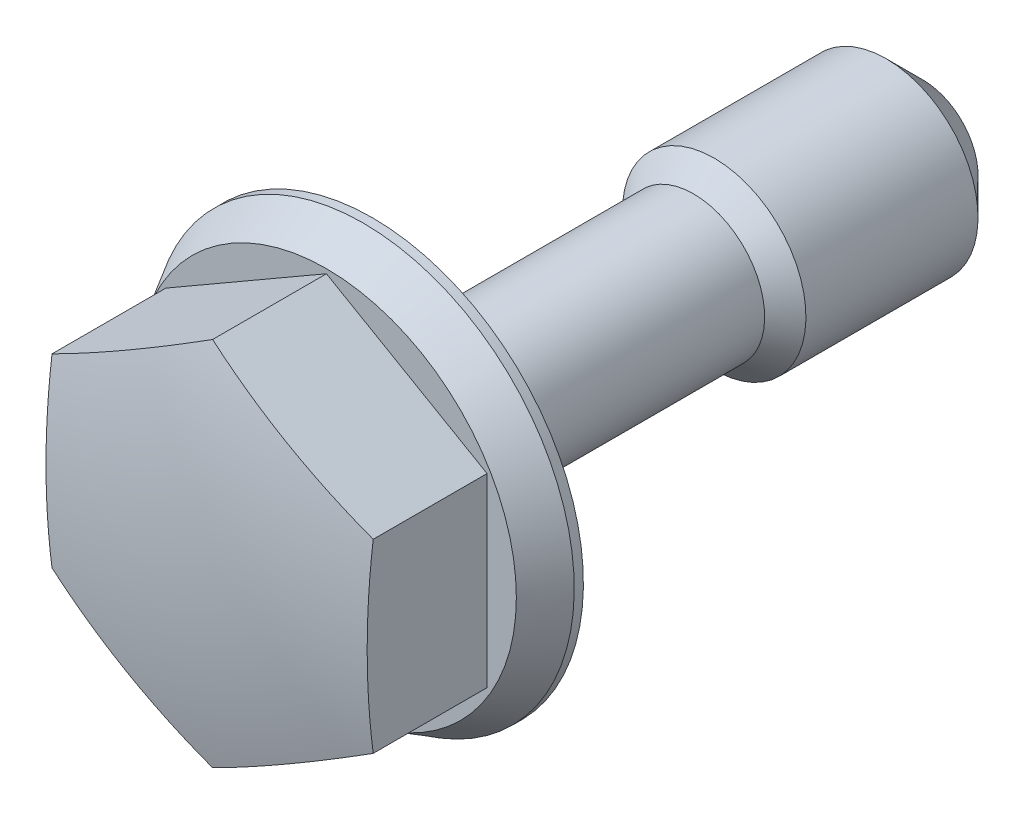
ISO-10303-21;
HEADER;
FILE_DESCRIPTION(('STEP AP214'),'2;1');
FILE_NAME('part.step','',(''),(''),'','','');
FILE_SCHEMA(('AUTOMOTIVE_DESIGN { 1 0 10303 214 1 1 1 1 }'));
ENDSEC;
DATA;
#1=APPLICATION_CONTEXT('core data for automotive mechanical design processes');
#2=APPLICATION_PROTOCOL_DEFINITION('international standard','automotive_design',2000,#1);
#3=PRODUCT_CONTEXT('',#1,'mechanical');
#4=PRODUCT('Part','Part','',(#3));
#5=PRODUCT_RELATED_PRODUCT_CATEGORY('part','',(#4));
#6=PRODUCT_DEFINITION_FORMATION('','',#4);
#7=PRODUCT_DEFINITION_CONTEXT('part definition',#1,'design');
#8=PRODUCT_DEFINITION('design','',#6,#7);
#9=PRODUCT_DEFINITION_SHAPE('','',#8);
#10=(LENGTH_UNIT() NAMED_UNIT(*) SI_UNIT(.MILLI.,.METRE.));
#11=(NAMED_UNIT(*) PLANE_ANGLE_UNIT() SI_UNIT($,.RADIAN.));
#12=(NAMED_UNIT(*) SI_UNIT($,.STERADIAN.) SOLID_ANGLE_UNIT());
#13=UNCERTAINTY_MEASURE_WITH_UNIT(LENGTH_MEASURE(1.E-05),#10,'distance_accuracy_value','');
#14=(GEOMETRIC_REPRESENTATION_CONTEXT(3) GLOBAL_UNCERTAINTY_ASSIGNED_CONTEXT((#13)) GLOBAL_UNIT_ASSIGNED_CONTEXT((#10,
#11,#12)) REPRESENTATION_CONTEXT('',''));
#15=CARTESIAN_POINT('',(0.,0.,0.));
#16=DIRECTION('',(0.,0.,1.));
#17=DIRECTION('',(1.,0.,0.));
#18=AXIS2_PLACEMENT_3D('',#15,#16,#17);
#19=CARTESIAN_POINT('',(0.,0.,1.));
#20=DIRECTION('',(0.,0.,-1.));
#21=DIRECTION('',(0.,1.,0.));
#22=AXIS2_PLACEMENT_3D('',#19,#20,#21);
#23=CONICAL_SURFACE('',#22,4.1381197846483,0.523598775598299);
#24=CARTESIAN_POINT('',(0.,0.,0.2));
#25=DIRECTION('',(0.,0.,-1.));
#26=DIRECTION('',(0.,1.,0.));
#27=AXIS2_PLACEMENT_3D('',#24,#25,#26);
#28=CIRCLE('',#27,4.6);
#29=CARTESIAN_POINT('',(0.,4.6,0.2));
#30=VERTEX_POINT('',#29);
#31=EDGE_CURVE('E117',#30,#30,#28,.T.);
#32=ORIENTED_EDGE('',*,*,#31,.F.);
#33=EDGE_LOOP('',(#32));
#34=FACE_BOUND('',#33,.T.);
#35=CARTESIAN_POINT('',(0.,0.,1.));
#36=DIRECTION('',(0.,0.,1.));
#37=DIRECTION('',(0.,-1.,0.));
#38=AXIS2_PLACEMENT_3D('',#35,#36,#37);
#39=CIRCLE('',#38,4.1381197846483);
#40=CARTESIAN_POINT('',(0.,-4.1381197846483,1.));
#41=VERTEX_POINT('',#40);
#42=EDGE_CURVE('E95',#41,#41,#39,.T.);
#43=ORIENTED_EDGE('',*,*,#42,.F.);
#44=EDGE_LOOP('',(#43));
#45=FACE_BOUND('',#44,.T.);
#46=ADVANCED_FACE('F14',(#34,#45),#23,.T.);
#47=CARTESIAN_POINT('',(0.,0.,-8.));
#48=DIRECTION('',(0.,0.,-1.));
#49=DIRECTION('',(0.,1.,0.));
#50=AXIS2_PLACEMENT_3D('',#47,#48,#49);
#51=CYLINDRICAL_SURFACE('',#50,4.6);
#52=CARTESIAN_POINT('',(0.,0.,0.));
#53=DIRECTION('',(0.,0.,-1.));
#54=DIRECTION('',(0.,1.,0.));
#55=AXIS2_PLACEMENT_3D('',#52,#53,#54);
#56=CIRCLE('',#55,4.6);
#57=CARTESIAN_POINT('',(0.,4.6,0.));
#58=VERTEX_POINT('',#57);
#59=EDGE_CURVE('E114',#58,#58,#56,.T.);
#60=ORIENTED_EDGE('',*,*,#59,.F.);
#61=EDGE_LOOP('',(#60));
#62=FACE_BOUND('',#61,.T.);
#63=ORIENTED_EDGE('',*,*,#31,.T.);
#64=EDGE_LOOP('',(#63));
#65=FACE_BOUND('',#64,.T.);
#66=ADVANCED_FACE('F156',(#62,#65),#51,.T.);
#67=CARTESIAN_POINT('',(4.6,0.,0.));
#68=DIRECTION('',(0.,0.,1.));
#69=DIRECTION('',(0.,-1.,0.));
#70=AXIS2_PLACEMENT_3D('',#67,#68,#69);
#71=PLANE('',#70);
#72=CARTESIAN_POINT('',(0.,0.,0.));
#73=DIRECTION('',(0.,0.,-1.));
#74=DIRECTION('',(0.,1.,0.));
#75=AXIS2_PLACEMENT_3D('',#72,#73,#74);
#76=CIRCLE('',#75,2.15);
#77=CARTESIAN_POINT('',(0.,2.15,0.));
#78=VERTEX_POINT('',#77);
#79=EDGE_CURVE('E111',#78,#78,#76,.T.);
#80=ORIENTED_EDGE('',*,*,#79,.F.);
#81=EDGE_LOOP('',(#80));
#82=FACE_BOUND('',#81,.T.);
#83=ORIENTED_EDGE('',*,*,#59,.T.);
#84=EDGE_LOOP('',(#83));
#85=FACE_BOUND('',#84,.T.);
#86=ADVANCED_FACE('F162',(#82,#85),#71,.F.);
#87=CARTESIAN_POINT('',(0.,0.,-0.6));
#88=DIRECTION('',(0.,0.,-1.));
#89=DIRECTION('',(0.,1.,0.));
#90=AXIS2_PLACEMENT_3D('',#87,#88,#89);
#91=TOROIDAL_SURFACE('',#90,2.15,0.6);
#92=CARTESIAN_POINT('',(0.,0.,-0.6));
#93=DIRECTION('',(0.,0.,-1.));
#94=DIRECTION('',(0.,1.,0.));
#95=AXIS2_PLACEMENT_3D('',#92,#93,#94);
#96=CIRCLE('',#95,1.55);
#97=CARTESIAN_POINT('',(0.,1.55,-0.6));
#98=VERTEX_POINT('',#97);
#99=EDGE_CURVE('E108',#98,#98,#96,.T.);
#100=ORIENTED_EDGE('',*,*,#99,.F.);
#101=EDGE_LOOP('',(#100));
#102=FACE_BOUND('',#101,.T.);
#103=ORIENTED_EDGE('',*,*,#79,.T.);
#104=EDGE_LOOP('',(#103));
#105=FACE_BOUND('',#104,.T.);
#106=ADVANCED_FACE('F195',(#102,#105),#91,.F.);
#107=CARTESIAN_POINT('',(0.,0.,-8.));
#108=DIRECTION('',(0.,0.,-1.));
#109=DIRECTION('',(0.,1.,0.));
#110=AXIS2_PLACEMENT_3D('',#107,#108,#109);
#111=CYLINDRICAL_SURFACE('',#110,1.55);
#112=ORIENTED_EDGE('',*,*,#99,.T.);
#113=EDGE_LOOP('',(#112));
#114=FACE_BOUND('',#113,.T.);
#115=CARTESIAN_POINT('',(0.,0.,-7.));
#116=DIRECTION('',(0.,0.,-1.));
#117=DIRECTION('',(0.,1.,0.));
#118=AXIS2_PLACEMENT_3D('',#115,#116,#117);
#119=CIRCLE('',#118,1.55);
#120=CARTESIAN_POINT('',(0.,1.55,-7.));
#121=VERTEX_POINT('',#120);
#122=EDGE_CURVE('E83',#121,#121,#119,.T.);
#123=ORIENTED_EDGE('',*,*,#122,.F.);
#124=EDGE_LOOP('',(#123));
#125=FACE_BOUND('',#124,.T.);
#126=ADVANCED_FACE('F193',(#114,#125),#111,.T.);
#127=CARTESIAN_POINT('',(0.,0.,1.));
#128=DIRECTION('',(0.,0.,1.));
#129=DIRECTION('',(0.,-1.,0.));
#130=AXIS2_PLACEMENT_3D('',#127,#128,#129);
#131=PLANE('',#130);
#132=DIRECTION('',(0.,-1.,0.));
#133=VECTOR('',#132,1.);
#134=CARTESIAN_POINT('',(-3.5,2.02072594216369,1.));
#135=LINE('',#134,#133);
#136=CARTESIAN_POINT('',(-3.5,2.02072594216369,1.));
#137=VERTEX_POINT('',#136);
#138=CARTESIAN_POINT('',(-3.5,-2.02072594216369,1.));
#139=VERTEX_POINT('',#138);
#140=EDGE_CURVE('E72',#137,#139,#135,.T.);
#141=ORIENTED_EDGE('',*,*,#140,.F.);
#142=DIRECTION('',(-0.866025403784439,-0.5,0.));
#143=VECTOR('',#142,1.);
#144=CARTESIAN_POINT('',(0.,4.04145188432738,1.));
#145=LINE('',#144,#143);
#146=CARTESIAN_POINT('',(0.,4.04145188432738,1.));
#147=VERTEX_POINT('',#146);
#148=EDGE_CURVE('E88',#147,#137,#145,.T.);
#149=ORIENTED_EDGE('',*,*,#148,.F.);
#150=DIRECTION('',(-0.866025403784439,0.5,0.));
#151=VECTOR('',#150,1.);
#152=CARTESIAN_POINT('',(3.5,2.02072594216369,1.));
#153=LINE('',#152,#151);
#154=CARTESIAN_POINT('',(3.5,2.02072594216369,1.));
#155=VERTEX_POINT('',#154);
#156=EDGE_CURVE('E90',#155,#147,#153,.T.);
#157=ORIENTED_EDGE('',*,*,#156,.F.);
#158=DIRECTION('',(0.,1.,0.));
#159=VECTOR('',#158,1.);
#160=CARTESIAN_POINT('',(3.5,-2.02072594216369,1.));
#161=LINE('',#160,#159);
#162=CARTESIAN_POINT('',(3.5,-2.02072594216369,1.));
#163=VERTEX_POINT('',#162);
#164=EDGE_CURVE('E184',#163,#155,#161,.T.);
#165=ORIENTED_EDGE('',*,*,#164,.F.);
#166=DIRECTION('',(0.866025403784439,0.5,0.));
#167=VECTOR('',#166,1.);
#168=CARTESIAN_POINT('',(0.,-4.04145188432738,1.));
#169=LINE('',#168,#167);
#170=CARTESIAN_POINT('',(0.,-4.04145188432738,1.));
#171=VERTEX_POINT('',#170);
#172=EDGE_CURVE('E82',#171,#163,#169,.T.);
#173=ORIENTED_EDGE('',*,*,#172,.F.);
#174=DIRECTION('',(0.866025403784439,-0.5,0.));
#175=VECTOR('',#174,1.);
#176=CARTESIAN_POINT('',(-3.5,-2.02072594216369,1.));
#177=LINE('',#176,#175);
#178=EDGE_CURVE('E68',#139,#171,#177,.T.);
#179=ORIENTED_EDGE('',*,*,#178,.F.);
#180=EDGE_LOOP('',(#141,#149,#157,#165,#173,#179));
#181=FACE_BOUND('',#180,.T.);
#182=ORIENTED_EDGE('',*,*,#42,.T.);
#183=EDGE_LOOP('',(#182));
#184=FACE_BOUND('',#183,.T.);
#185=ADVANCED_FACE('F77',(#181,#184),#131,.T.);
#186=CARTESIAN_POINT('',(-3.5,2.02072594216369,1.));
#187=DIRECTION('',(-1.,0.,0.));
#188=DIRECTION('',(0.,-1.,0.));
#189=AXIS2_PLACEMENT_3D('',#186,#187,#188);
#190=PLANE('',#189);
#191=DIRECTION('',(0.,0.,1.));
#192=VECTOR('',#191,1.);
#193=CARTESIAN_POINT('',(-3.5,2.02072594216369,1.));
#194=LINE('',#193,#192);
#195=CARTESIAN_POINT('',(-3.5,2.02072594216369,3.48117135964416));
#196=VERTEX_POINT('',#195);
#197=EDGE_CURVE('E86',#137,#196,#194,.T.);
#198=ORIENTED_EDGE('',*,*,#197,.F.);
#199=ORIENTED_EDGE('',*,*,#140,.T.);
#200=DIRECTION('',(0.,0.,1.));
#201=VECTOR('',#200,1.);
#202=CARTESIAN_POINT('',(-3.5,-2.02072594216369,1.));
#203=LINE('',#202,#201);
#204=CARTESIAN_POINT('',(-3.5,-2.02072594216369,3.48117135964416));
#205=VERTEX_POINT('',#204);
#206=EDGE_CURVE('E65',#139,#205,#203,.T.);
#207=ORIENTED_EDGE('',*,*,#206,.T.);
#208=CARTESIAN_POINT('',(-3.5,0.,-12.));
#209=DIRECTION('',(-1.,0.,0.));
#210=DIRECTION('',(0.,-1.,0.));
#211=AXIS2_PLACEMENT_3D('',#208,#209,#210);
#212=CIRCLE('',#211,15.612494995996);
#213=EDGE_CURVE('E37',#196,#205,#212,.F.);
#214=ORIENTED_EDGE('',*,*,#213,.F.);
#215=EDGE_LOOP('',(#198,#199,#207,#214));
#216=FACE_BOUND('',#215,.T.);
#217=ADVANCED_FACE('F85',(#216),#190,.T.);
#218=CARTESIAN_POINT('',(0.,4.04145188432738,1.));
#219=DIRECTION('',(-0.5,0.866025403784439,0.));
#220=DIRECTION('',(-0.866025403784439,-0.5,0.));
#221=AXIS2_PLACEMENT_3D('',#218,#219,#220);
#222=PLANE('',#221);
#223=DIRECTION('',(0.,0.,1.));
#224=VECTOR('',#223,1.);
#225=CARTESIAN_POINT('',(0.,4.04145188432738,1.));
#226=LINE('',#225,#224);
#227=CARTESIAN_POINT('',(0.,4.04145188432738,3.48117135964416));
#228=VERTEX_POINT('',#227);
#229=EDGE_CURVE('E96',#147,#228,#226,.T.);
#230=ORIENTED_EDGE('',*,*,#229,.F.);
#231=ORIENTED_EDGE('',*,*,#148,.T.);
#232=ORIENTED_EDGE('',*,*,#197,.T.);
#233=CARTESIAN_POINT('',(-1.75,3.03108891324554,-12.));
#234=DIRECTION('',(-0.5,0.866025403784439,0.));
#235=DIRECTION('',(-0.866025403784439,-0.5,0.));
#236=AXIS2_PLACEMENT_3D('',#233,#234,#235);
#237=CIRCLE('',#236,15.612494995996);
#238=EDGE_CURVE('E130',#228,#196,#237,.F.);
#239=ORIENTED_EDGE('',*,*,#238,.F.);
#240=EDGE_LOOP('',(#230,#231,#232,#239));
#241=FACE_BOUND('',#240,.T.);
#242=ADVANCED_FACE('F245',(#241),#222,.T.);
#243=CARTESIAN_POINT('',(3.5,2.02072594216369,1.));
#244=DIRECTION('',(0.5,0.866025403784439,0.));
#245=DIRECTION('',(-0.866025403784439,0.5,0.));
#246=AXIS2_PLACEMENT_3D('',#243,#244,#245);
#247=PLANE('',#246);
#248=DIRECTION('',(0.,0.,1.));
#249=VECTOR('',#248,1.);
#250=CARTESIAN_POINT('',(3.5,2.02072594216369,1.));
#251=LINE('',#250,#249);
#252=CARTESIAN_POINT('',(3.5,2.02072594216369,3.48117135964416));
#253=VERTEX_POINT('',#252);
#254=EDGE_CURVE('E99',#155,#253,#251,.T.);
#255=ORIENTED_EDGE('',*,*,#254,.F.);
#256=ORIENTED_EDGE('',*,*,#156,.T.);
#257=ORIENTED_EDGE('',*,*,#229,.T.);
#258=CARTESIAN_POINT('',(1.75,3.03108891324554,-12.));
#259=DIRECTION('',(0.5,0.866025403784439,0.));
#260=DIRECTION('',(-0.866025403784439,0.5,0.));
#261=AXIS2_PLACEMENT_3D('',#258,#259,#260);
#262=CIRCLE('',#261,15.612494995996);
#263=EDGE_CURVE('E127',#253,#228,#262,.F.);
#264=ORIENTED_EDGE('',*,*,#263,.F.);
#265=EDGE_LOOP('',(#255,#256,#257,#264));
#266=FACE_BOUND('',#265,.T.);
#267=ADVANCED_FACE('F178',(#266),#247,.T.);
#268=CARTESIAN_POINT('',(3.5,-2.02072594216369,1.));
#269=DIRECTION('',(1.,0.,0.));
#270=DIRECTION('',(0.,1.,0.));
#271=AXIS2_PLACEMENT_3D('',#268,#269,#270);
#272=PLANE('',#271);
#273=DIRECTION('',(0.,0.,1.));
#274=VECTOR('',#273,1.);
#275=CARTESIAN_POINT('',(3.5,-2.02072594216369,1.));
#276=LINE('',#275,#274);
#277=CARTESIAN_POINT('',(3.5,-2.02072594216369,3.48117135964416));
#278=VERTEX_POINT('',#277);
#279=EDGE_CURVE('E102',#163,#278,#276,.T.);
#280=ORIENTED_EDGE('',*,*,#279,.F.);
#281=ORIENTED_EDGE('',*,*,#164,.T.);
#282=ORIENTED_EDGE('',*,*,#254,.T.);
#283=CARTESIAN_POINT('',(3.5,0.,-12.));
#284=DIRECTION('',(1.,0.,0.));
#285=DIRECTION('',(0.,1.,0.));
#286=AXIS2_PLACEMENT_3D('',#283,#284,#285);
#287=CIRCLE('',#286,15.612494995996);
#288=EDGE_CURVE('E124',#278,#253,#287,.F.);
#289=ORIENTED_EDGE('',*,*,#288,.F.);
#290=EDGE_LOOP('',(#280,#281,#282,#289));
#291=FACE_BOUND('',#290,.T.);
#292=ADVANCED_FACE('F183',(#291),#272,.T.);
#293=CARTESIAN_POINT('',(0.,-4.04145188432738,1.));
#294=DIRECTION('',(0.5,-0.866025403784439,0.));
#295=DIRECTION('',(0.866025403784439,0.5,0.));
#296=AXIS2_PLACEMENT_3D('',#293,#294,#295);
#297=PLANE('',#296);
#298=DIRECTION('',(0.,0.,1.));
#299=VECTOR('',#298,1.);
#300=CARTESIAN_POINT('',(0.,-4.04145188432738,1.));
#301=LINE('',#300,#299);
#302=CARTESIAN_POINT('',(0.,-4.04145188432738,3.48117135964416));
#303=VERTEX_POINT('',#302);
#304=EDGE_CURVE('E29',#171,#303,#301,.T.);
#305=ORIENTED_EDGE('',*,*,#304,.F.);
#306=ORIENTED_EDGE('',*,*,#172,.T.);
#307=ORIENTED_EDGE('',*,*,#279,.T.);
#308=CARTESIAN_POINT('',(1.75,-3.03108891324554,-12.));
#309=DIRECTION('',(0.5,-0.866025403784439,0.));
#310=DIRECTION('',(0.866025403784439,0.5,0.));
#311=AXIS2_PLACEMENT_3D('',#308,#309,#310);
#312=CIRCLE('',#311,15.612494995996);
#313=EDGE_CURVE('E121',#303,#278,#312,.F.);
#314=ORIENTED_EDGE('',*,*,#313,.F.);
#315=EDGE_LOOP('',(#305,#306,#307,#314));
#316=FACE_BOUND('',#315,.T.);
#317=ADVANCED_FACE('F174',(#316),#297,.T.);
#318=CARTESIAN_POINT('',(-3.5,-2.02072594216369,1.));
#319=DIRECTION('',(-0.5,-0.866025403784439,0.));
#320=DIRECTION('',(0.866025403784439,-0.5,0.));
#321=AXIS2_PLACEMENT_3D('',#318,#319,#320);
#322=PLANE('',#321);
#323=ORIENTED_EDGE('',*,*,#206,.F.);
#324=ORIENTED_EDGE('',*,*,#178,.T.);
#325=ORIENTED_EDGE('',*,*,#304,.T.);
#326=CARTESIAN_POINT('',(-1.75,-3.03108891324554,-12.));
#327=DIRECTION('',(-0.5,-0.866025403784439,0.));
#328=DIRECTION('',(0.866025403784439,-0.5,0.));
#329=AXIS2_PLACEMENT_3D('',#326,#327,#328);
#330=CIRCLE('',#329,15.612494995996);
#331=EDGE_CURVE('E70',#205,#303,#330,.F.);
#332=ORIENTED_EDGE('',*,*,#331,.F.);
#333=EDGE_LOOP('',(#323,#324,#325,#332));
#334=FACE_BOUND('',#333,.T.);
#335=ADVANCED_FACE('F67',(#334),#322,.T.);
#336=CARTESIAN_POINT('',(0.,0.,-12.));
#337=DIRECTION('',(0.,0.,-1.));
#338=DIRECTION('',(1.,0.,0.));
#339=AXIS2_PLACEMENT_3D('',#336,#337,#338);
#340=SPHERICAL_SURFACE('',#339,16.);
#341=ORIENTED_EDGE('',*,*,#263,.T.);
#342=ORIENTED_EDGE('',*,*,#238,.T.);
#343=ORIENTED_EDGE('',*,*,#213,.T.);
#344=ORIENTED_EDGE('',*,*,#331,.T.);
#345=ORIENTED_EDGE('',*,*,#313,.T.);
#346=ORIENTED_EDGE('',*,*,#288,.T.);
#347=EDGE_LOOP('',(#341,#342,#343,#344,#345,#346));
#348=FACE_BOUND('',#347,.T.);
#349=ADVANCED_FACE('F152',(#348),#340,.T.);
#350=CARTESIAN_POINT('',(0.,0.,-12.));
#351=DIRECTION('',(0.,0.,1.));
#352=DIRECTION('',(0.,-1.,0.));
#353=AXIS2_PLACEMENT_3D('',#350,#351,#352);
#354=CYLINDRICAL_SURFACE('',#353,2.);
#355=CARTESIAN_POINT('',(0.,0.,-7.45));
#356=DIRECTION('',(0.,0.,-1.));
#357=DIRECTION('',(0.,1.,0.));
#358=AXIS2_PLACEMENT_3D('',#355,#356,#357);
#359=CIRCLE('',#358,2.);
#360=CARTESIAN_POINT('',(0.,2.,-7.45));
#361=VERTEX_POINT('',#360);
#362=EDGE_CURVE('E9',#361,#361,#359,.T.);
#363=ORIENTED_EDGE('',*,*,#362,.T.);
#364=EDGE_LOOP('',(#363));
#365=FACE_BOUND('',#364,.T.);
#366=CARTESIAN_POINT('',(0.,0.,-11.2));
#367=DIRECTION('',(0.,0.,-1.));
#368=DIRECTION('',(0.,1.,0.));
#369=AXIS2_PLACEMENT_3D('',#366,#367,#368);
#370=CIRCLE('',#369,2.);
#371=CARTESIAN_POINT('',(0.,2.,-11.2));
#372=VERTEX_POINT('',#371);
#373=EDGE_CURVE('E22',#372,#372,#370,.F.);
#374=ORIENTED_EDGE('',*,*,#373,.T.);
#375=EDGE_LOOP('',(#374));
#376=FACE_BOUND('',#375,.T.);
#377=ADVANCED_FACE('F138',(#365,#376),#354,.T.);
#378=CARTESIAN_POINT('',(0.,0.,-12.));
#379=DIRECTION('',(0.,0.,-1.));
#380=DIRECTION('',(0.,1.,0.));
#381=AXIS2_PLACEMENT_3D('',#378,#379,#380);
#382=PLANE('',#381);
#383=CARTESIAN_POINT('',(0.,0.,-12.));
#384=DIRECTION('',(0.,0.,-1.));
#385=DIRECTION('',(0.,1.,0.));
#386=AXIS2_PLACEMENT_3D('',#383,#384,#385);
#387=CIRCLE('',#386,1.2);
#388=CARTESIAN_POINT('',(0.,1.2,-12.));
#389=VERTEX_POINT('',#388);
#390=EDGE_CURVE('E133',#389,#389,#387,.T.);
#391=ORIENTED_EDGE('',*,*,#390,.T.);
#392=EDGE_LOOP('',(#391));
#393=FACE_BOUND('',#392,.T.);
#394=ADVANCED_FACE('F143',(#393),#382,.T.);
#395=CARTESIAN_POINT('',(0.,0.,-12.));
#396=DIRECTION('',(0.,0.,1.));
#397=DIRECTION('',(0.,-1.,0.));
#398=AXIS2_PLACEMENT_3D('',#395,#396,#397);
#399=CONICAL_SURFACE('',#398,1.2,0.785398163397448);
#400=ORIENTED_EDGE('',*,*,#373,.F.);
#401=EDGE_LOOP('',(#400));
#402=FACE_BOUND('',#401,.T.);
#403=ORIENTED_EDGE('',*,*,#390,.F.);
#404=EDGE_LOOP('',(#403));
#405=FACE_BOUND('',#404,.T.);
#406=ADVANCED_FACE('F140',(#402,#405),#399,.T.);
#407=CARTESIAN_POINT('',(0.,0.,-7.45));
#408=DIRECTION('',(0.,0.,-1.));
#409=DIRECTION('',(0.,1.,0.));
#410=AXIS2_PLACEMENT_3D('',#407,#408,#409);
#411=CONICAL_SURFACE('',#410,2.,0.785398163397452);
#412=ORIENTED_EDGE('',*,*,#122,.T.);
#413=EDGE_LOOP('',(#412));
#414=FACE_BOUND('',#413,.T.);
#415=ORIENTED_EDGE('',*,*,#362,.F.);
#416=EDGE_LOOP('',(#415));
#417=FACE_BOUND('',#416,.T.);
#418=ADVANCED_FACE('F16',(#414,#417),#411,.T.);
#419=CLOSED_SHELL('',(#46,#66,#86,#106,#126,#185,#217,#242,#267,#292,#317,#335,#349,#377,#394,
#406,#418));
#420=MANIFOLD_SOLID_BREP('B1',#419);
#421=ADVANCED_BREP_SHAPE_REPRESENTATION('',(#18,#420),#14);
#422=SHAPE_DEFINITION_REPRESENTATION(#9,#421);
ENDSEC;
END-ISO-10303-21;
